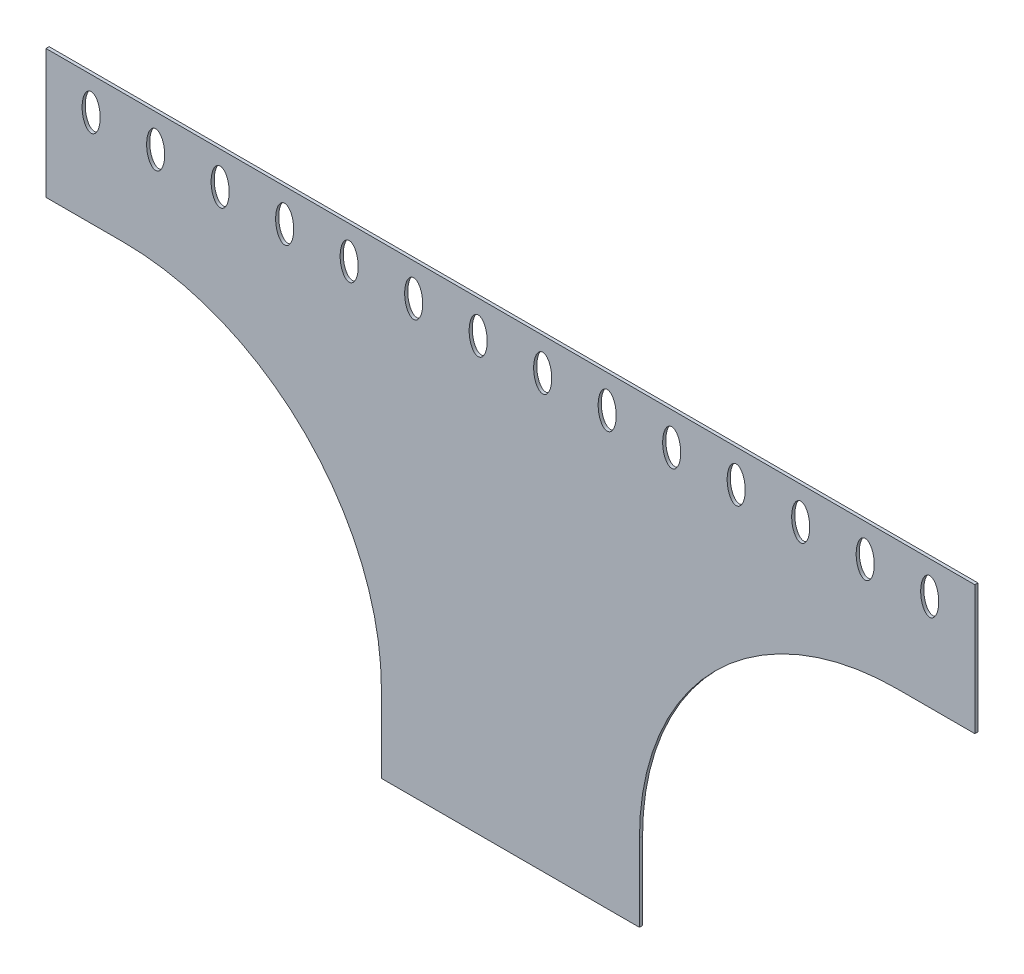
ISO-10303-21;
HEADER;
FILE_DESCRIPTION(('STEP AP214'),'2;1');
FILE_NAME('part.step','',(''),(''),'','','');
FILE_SCHEMA(('AUTOMOTIVE_DESIGN { 1 0 10303 214 1 1 1 1 }'));
ENDSEC;
DATA;
#1=APPLICATION_CONTEXT('core data for automotive mechanical design processes');
#2=APPLICATION_PROTOCOL_DEFINITION('international standard','automotive_design',2000,#1);
#3=PRODUCT_CONTEXT('',#1,'mechanical');
#4=PRODUCT('Part','Part','',(#3));
#5=PRODUCT_RELATED_PRODUCT_CATEGORY('part','',(#4));
#6=PRODUCT_DEFINITION_FORMATION('','',#4);
#7=PRODUCT_DEFINITION_CONTEXT('part definition',#1,'design');
#8=PRODUCT_DEFINITION('design','',#6,#7);
#9=PRODUCT_DEFINITION_SHAPE('','',#8);
#10=(LENGTH_UNIT() NAMED_UNIT(*) SI_UNIT(.MILLI.,.METRE.));
#11=(NAMED_UNIT(*) PLANE_ANGLE_UNIT() SI_UNIT($,.RADIAN.));
#12=(NAMED_UNIT(*) SI_UNIT($,.STERADIAN.) SOLID_ANGLE_UNIT());
#13=UNCERTAINTY_MEASURE_WITH_UNIT(LENGTH_MEASURE(1.E-05),#10,'distance_accuracy_value','');
#14=(GEOMETRIC_REPRESENTATION_CONTEXT(3) GLOBAL_UNCERTAINTY_ASSIGNED_CONTEXT((#13)) GLOBAL_UNIT_ASSIGNED_CONTEXT((#10,
#11,#12)) REPRESENTATION_CONTEXT('',''));
#15=CARTESIAN_POINT('',(0.,0.,0.));
#16=DIRECTION('',(0.,0.,1.));
#17=DIRECTION('',(1.,0.,0.));
#18=AXIS2_PLACEMENT_3D('',#15,#16,#17);
#19=CARTESIAN_POINT('',(0.,30.,1.21412));
#20=DIRECTION('',(1.,0.,0.));
#21=DIRECTION('',(0.,1.,0.));
#22=AXIS2_PLACEMENT_3D('',#19,#20,#21);
#23=PLANE('',#22);
#24=DIRECTION('',(0.,-1.,0.));
#25=VECTOR('',#24,1.);
#26=CARTESIAN_POINT('',(0.,30.,0.));
#27=LINE('',#26,#25);
#28=CARTESIAN_POINT('',(0.,30.,0.));
#29=VERTEX_POINT('',#28);
#30=CARTESIAN_POINT('',(0.,0.,0.));
#31=VERTEX_POINT('',#30);
#32=EDGE_CURVE('E143',#29,#31,#27,.T.);
#33=ORIENTED_EDGE('',*,*,#32,.T.);
#34=DIRECTION('',(0.,0.,-1.));
#35=VECTOR('',#34,1.);
#36=CARTESIAN_POINT('',(0.,0.,1.21412));
#37=LINE('',#36,#35);
#38=CARTESIAN_POINT('',(0.,0.,1.21412));
#39=VERTEX_POINT('',#38);
#40=EDGE_CURVE('E11',#39,#31,#37,.T.);
#41=ORIENTED_EDGE('',*,*,#40,.F.);
#42=DIRECTION('',(0.,-1.,0.));
#43=VECTOR('',#42,1.);
#44=CARTESIAN_POINT('',(0.,30.,1.21412));
#45=LINE('',#44,#43);
#46=CARTESIAN_POINT('',(0.,30.,1.21412));
#47=VERTEX_POINT('',#46);
#48=EDGE_CURVE('E162',#47,#39,#45,.T.);
#49=ORIENTED_EDGE('',*,*,#48,.F.);
#50=DIRECTION('',(0.,0.,-1.));
#51=VECTOR('',#50,1.);
#52=CARTESIAN_POINT('',(0.,30.,1.21412));
#53=LINE('',#52,#51);
#54=EDGE_CURVE('E139',#47,#29,#53,.T.);
#55=ORIENTED_EDGE('',*,*,#54,.T.);
#56=EDGE_LOOP('',(#33,#41,#49,#55));
#57=FACE_BOUND('',#56,.T.);
#58=ADVANCED_FACE('F33',(#57),#23,.F.);
#59=CARTESIAN_POINT('',(0.,0.,1.21412));
#60=DIRECTION('',(0.,1.,0.));
#61=DIRECTION('',(0.,0.,1.));
#62=AXIS2_PLACEMENT_3D('',#59,#60,#61);
#63=PLANE('',#62);
#64=DIRECTION('',(1.,0.,0.));
#65=VECTOR('',#64,1.);
#66=CARTESIAN_POINT('',(0.,0.,0.));
#67=LINE('',#66,#65);
#68=CARTESIAN_POINT('',(100.,0.,0.));
#69=VERTEX_POINT('',#68);
#70=EDGE_CURVE('E146',#31,#69,#67,.T.);
#71=ORIENTED_EDGE('',*,*,#70,.T.);
#72=DIRECTION('',(0.,0.,-1.));
#73=VECTOR('',#72,1.);
#74=CARTESIAN_POINT('',(100.,0.,1.21412));
#75=LINE('',#74,#73);
#76=CARTESIAN_POINT('',(100.,0.,1.21412));
#77=VERTEX_POINT('',#76);
#78=EDGE_CURVE('E42',#77,#69,#75,.T.);
#79=ORIENTED_EDGE('',*,*,#78,.F.);
#80=DIRECTION('',(1.,0.,0.));
#81=VECTOR('',#80,1.);
#82=CARTESIAN_POINT('',(0.,0.,1.21412));
#83=LINE('',#82,#81);
#84=EDGE_CURVE('E100',#39,#77,#83,.T.);
#85=ORIENTED_EDGE('',*,*,#84,.F.);
#86=ORIENTED_EDGE('',*,*,#40,.T.);
#87=EDGE_LOOP('',(#71,#79,#85,#86));
#88=FACE_BOUND('',#87,.T.);
#89=ADVANCED_FACE('F367',(#88),#63,.F.);
#90=CARTESIAN_POINT('',(100.,0.,1.21412));
#91=DIRECTION('',(-1.,0.,0.));
#92=DIRECTION('',(0.,0.,1.));
#93=AXIS2_PLACEMENT_3D('',#90,#91,#92);
#94=PLANE('',#93);
#95=DIRECTION('',(0.,1.,0.));
#96=VECTOR('',#95,1.);
#97=CARTESIAN_POINT('',(100.,0.,0.));
#98=LINE('',#97,#96);
#99=CARTESIAN_POINT('',(100.,30.,0.));
#100=VERTEX_POINT('',#99);
#101=EDGE_CURVE('E149',#69,#100,#98,.T.);
#102=ORIENTED_EDGE('',*,*,#101,.T.);
#103=DIRECTION('',(0.,0.,-1.));
#104=VECTOR('',#103,1.);
#105=CARTESIAN_POINT('',(100.,30.,1.21412));
#106=LINE('',#105,#104);
#107=CARTESIAN_POINT('',(100.,30.,1.21412));
#108=VERTEX_POINT('',#107);
#109=EDGE_CURVE('E175',#108,#100,#106,.T.);
#110=ORIENTED_EDGE('',*,*,#109,.F.);
#111=DIRECTION('',(0.,1.,0.));
#112=VECTOR('',#111,1.);
#113=CARTESIAN_POINT('',(100.,0.,1.21412));
#114=LINE('',#113,#112);
#115=EDGE_CURVE('E332',#77,#108,#114,.T.);
#116=ORIENTED_EDGE('',*,*,#115,.F.);
#117=ORIENTED_EDGE('',*,*,#78,.T.);
#118=EDGE_LOOP('',(#102,#110,#116,#117));
#119=FACE_BOUND('',#118,.T.);
#120=ADVANCED_FACE('F371',(#119),#94,.F.);
#121=CARTESIAN_POINT('',(200.,30.,1.21412));
#122=DIRECTION('',(0.,0.,-1.));
#123=DIRECTION('',(-1.,0.,0.));
#124=AXIS2_PLACEMENT_3D('',#121,#122,#123);
#125=CYLINDRICAL_SURFACE('',#124,100.);
#126=CARTESIAN_POINT('',(200.,30.,0.));
#127=DIRECTION('',(0.,0.,-1.));
#128=DIRECTION('',(-1.,0.,0.));
#129=AXIS2_PLACEMENT_3D('',#126,#127,#128);
#130=CIRCLE('',#129,100.);
#131=CARTESIAN_POINT('',(200.,130.,0.));
#132=VERTEX_POINT('',#131);
#133=EDGE_CURVE('E151',#100,#132,#130,.T.);
#134=ORIENTED_EDGE('',*,*,#133,.T.);
#135=DIRECTION('',(0.,0.,-1.));
#136=VECTOR('',#135,1.);
#137=CARTESIAN_POINT('',(200.,130.,1.21412));
#138=LINE('',#137,#136);
#139=CARTESIAN_POINT('',(200.,130.,1.21412));
#140=VERTEX_POINT('',#139);
#141=EDGE_CURVE('E172',#140,#132,#138,.T.);
#142=ORIENTED_EDGE('',*,*,#141,.F.);
#143=CARTESIAN_POINT('',(200.,30.,1.21412));
#144=DIRECTION('',(0.,0.,-1.));
#145=DIRECTION('',(-1.,0.,0.));
#146=AXIS2_PLACEMENT_3D('',#143,#144,#145);
#147=CIRCLE('',#146,100.);
#148=EDGE_CURVE('E334',#108,#140,#147,.T.);
#149=ORIENTED_EDGE('',*,*,#148,.F.);
#150=ORIENTED_EDGE('',*,*,#109,.T.);
#151=EDGE_LOOP('',(#134,#142,#149,#150));
#152=FACE_BOUND('',#151,.T.);
#153=ADVANCED_FACE('F375',(#152),#125,.F.);
#154=CARTESIAN_POINT('',(200.,130.,1.21412));
#155=DIRECTION('',(0.,1.,0.));
#156=DIRECTION('',(0.,0.,1.));
#157=AXIS2_PLACEMENT_3D('',#154,#155,#156);
#158=PLANE('',#157);
#159=DIRECTION('',(1.,0.,0.));
#160=VECTOR('',#159,1.);
#161=CARTESIAN_POINT('',(200.,130.,0.));
#162=LINE('',#161,#160);
#163=CARTESIAN_POINT('',(230.,130.,0.));
#164=VERTEX_POINT('',#163);
#165=EDGE_CURVE('E153',#132,#164,#162,.T.);
#166=ORIENTED_EDGE('',*,*,#165,.T.);
#167=DIRECTION('',(0.,0.,-1.));
#168=VECTOR('',#167,1.);
#169=CARTESIAN_POINT('',(230.,130.,1.21412));
#170=LINE('',#169,#168);
#171=CARTESIAN_POINT('',(230.,130.,1.21412));
#172=VERTEX_POINT('',#171);
#173=EDGE_CURVE('E169',#172,#164,#170,.T.);
#174=ORIENTED_EDGE('',*,*,#173,.F.);
#175=DIRECTION('',(1.,0.,0.));
#176=VECTOR('',#175,1.);
#177=CARTESIAN_POINT('',(200.,130.,1.21412));
#178=LINE('',#177,#176);
#179=EDGE_CURVE('E336',#140,#172,#178,.T.);
#180=ORIENTED_EDGE('',*,*,#179,.F.);
#181=ORIENTED_EDGE('',*,*,#141,.T.);
#182=EDGE_LOOP('',(#166,#174,#180,#181));
#183=FACE_BOUND('',#182,.T.);
#184=ADVANCED_FACE('F381',(#183),#158,.F.);
#185=CARTESIAN_POINT('',(230.,130.,1.21412));
#186=DIRECTION('',(-1.,0.,0.));
#187=DIRECTION('',(0.,0.,1.));
#188=AXIS2_PLACEMENT_3D('',#185,#186,#187);
#189=PLANE('',#188);
#190=DIRECTION('',(0.,1.,0.));
#191=VECTOR('',#190,1.);
#192=CARTESIAN_POINT('',(230.,130.,0.));
#193=LINE('',#192,#191);
#194=CARTESIAN_POINT('',(230.,180.,0.));
#195=VERTEX_POINT('',#194);
#196=EDGE_CURVE('E155',#164,#195,#193,.T.);
#197=ORIENTED_EDGE('',*,*,#196,.T.);
#198=DIRECTION('',(0.,0.,-1.));
#199=VECTOR('',#198,1.);
#200=CARTESIAN_POINT('',(230.,180.,1.21412));
#201=LINE('',#200,#199);
#202=CARTESIAN_POINT('',(230.,180.,1.21412));
#203=VERTEX_POINT('',#202);
#204=EDGE_CURVE('E166',#203,#195,#201,.T.);
#205=ORIENTED_EDGE('',*,*,#204,.F.);
#206=DIRECTION('',(0.,1.,0.));
#207=VECTOR('',#206,1.);
#208=CARTESIAN_POINT('',(230.,130.,1.21412));
#209=LINE('',#208,#207);
#210=EDGE_CURVE('E338',#172,#203,#209,.T.);
#211=ORIENTED_EDGE('',*,*,#210,.F.);
#212=ORIENTED_EDGE('',*,*,#173,.T.);
#213=EDGE_LOOP('',(#197,#205,#211,#212));
#214=FACE_BOUND('',#213,.T.);
#215=ADVANCED_FACE('F344',(#214),#189,.F.);
#216=CARTESIAN_POINT('',(230.,180.,1.21412));
#217=DIRECTION('',(0.,-1.,0.));
#218=DIRECTION('',(1.,0.,0.));
#219=AXIS2_PLACEMENT_3D('',#216,#217,#218);
#220=PLANE('',#219);
#221=DIRECTION('',(-1.,0.,0.));
#222=VECTOR('',#221,1.);
#223=CARTESIAN_POINT('',(230.,180.,0.));
#224=LINE('',#223,#222);
#225=CARTESIAN_POINT('',(-130.,180.,0.));
#226=VERTEX_POINT('',#225);
#227=EDGE_CURVE('E157',#195,#226,#224,.T.);
#228=ORIENTED_EDGE('',*,*,#227,.T.);
#229=DIRECTION('',(0.,0.,-1.));
#230=VECTOR('',#229,1.);
#231=CARTESIAN_POINT('',(-130.,180.,1.21412));
#232=LINE('',#231,#230);
#233=CARTESIAN_POINT('',(-130.,180.,1.21412));
#234=VERTEX_POINT('',#233);
#235=EDGE_CURVE('E134',#234,#226,#232,.T.);
#236=ORIENTED_EDGE('',*,*,#235,.F.);
#237=DIRECTION('',(-1.,0.,0.));
#238=VECTOR('',#237,1.);
#239=CARTESIAN_POINT('',(230.,180.,1.21412));
#240=LINE('',#239,#238);
#241=EDGE_CURVE('E125',#203,#234,#240,.T.);
#242=ORIENTED_EDGE('',*,*,#241,.F.);
#243=ORIENTED_EDGE('',*,*,#204,.T.);
#244=EDGE_LOOP('',(#228,#236,#242,#243));
#245=FACE_BOUND('',#244,.T.);
#246=ADVANCED_FACE('F348',(#245),#220,.F.);
#247=CARTESIAN_POINT('',(-130.,180.,1.21412));
#248=DIRECTION('',(1.,0.,0.));
#249=DIRECTION('',(0.,1.,0.));
#250=AXIS2_PLACEMENT_3D('',#247,#248,#249);
#251=PLANE('',#250);
#252=DIRECTION('',(0.,-1.,0.));
#253=VECTOR('',#252,1.);
#254=CARTESIAN_POINT('',(-130.,180.,0.));
#255=LINE('',#254,#253);
#256=CARTESIAN_POINT('',(-130.,130.,0.));
#257=VERTEX_POINT('',#256);
#258=EDGE_CURVE('E133',#226,#257,#255,.T.);
#259=ORIENTED_EDGE('',*,*,#258,.T.);
#260=DIRECTION('',(0.,0.,-1.));
#261=VECTOR('',#260,1.);
#262=CARTESIAN_POINT('',(-130.,130.,1.21412));
#263=LINE('',#262,#261);
#264=CARTESIAN_POINT('',(-130.,130.,1.21412));
#265=VERTEX_POINT('',#264);
#266=EDGE_CURVE('E130',#265,#257,#263,.T.);
#267=ORIENTED_EDGE('',*,*,#266,.F.);
#268=DIRECTION('',(0.,-1.,0.));
#269=VECTOR('',#268,1.);
#270=CARTESIAN_POINT('',(-130.,180.,1.21412));
#271=LINE('',#270,#269);
#272=EDGE_CURVE('E119',#234,#265,#271,.T.);
#273=ORIENTED_EDGE('',*,*,#272,.F.);
#274=ORIENTED_EDGE('',*,*,#235,.T.);
#275=EDGE_LOOP('',(#259,#267,#273,#274));
#276=FACE_BOUND('',#275,.T.);
#277=ADVANCED_FACE('F131',(#276),#251,.F.);
#278=CARTESIAN_POINT('',(-130.,130.,1.21412));
#279=DIRECTION('',(0.,1.,0.));
#280=DIRECTION('',(0.,0.,1.));
#281=AXIS2_PLACEMENT_3D('',#278,#279,#280);
#282=PLANE('',#281);
#283=DIRECTION('',(1.,0.,0.));
#284=VECTOR('',#283,1.);
#285=CARTESIAN_POINT('',(-130.,130.,0.));
#286=LINE('',#285,#284);
#287=CARTESIAN_POINT('',(-100.,130.,0.));
#288=VERTEX_POINT('',#287);
#289=EDGE_CURVE('E86',#257,#288,#286,.T.);
#290=ORIENTED_EDGE('',*,*,#289,.T.);
#291=DIRECTION('',(0.,0.,-1.));
#292=VECTOR('',#291,1.);
#293=CARTESIAN_POINT('',(-100.,130.,1.21412));
#294=LINE('',#293,#292);
#295=CARTESIAN_POINT('',(-100.,130.,1.21412));
#296=VERTEX_POINT('',#295);
#297=EDGE_CURVE('E135',#296,#288,#294,.T.);
#298=ORIENTED_EDGE('',*,*,#297,.F.);
#299=DIRECTION('',(1.,0.,0.));
#300=VECTOR('',#299,1.);
#301=CARTESIAN_POINT('',(-130.,130.,1.21412));
#302=LINE('',#301,#300);
#303=EDGE_CURVE('E123',#265,#296,#302,.T.);
#304=ORIENTED_EDGE('',*,*,#303,.F.);
#305=ORIENTED_EDGE('',*,*,#266,.T.);
#306=EDGE_LOOP('',(#290,#298,#304,#305));
#307=FACE_BOUND('',#306,.T.);
#308=ADVANCED_FACE('F137',(#307),#282,.F.);
#309=CARTESIAN_POINT('',(-100.,30.,1.21412));
#310=DIRECTION('',(0.,0.,-1.));
#311=DIRECTION('',(-1.,0.,0.));
#312=AXIS2_PLACEMENT_3D('',#309,#310,#311);
#313=CYLINDRICAL_SURFACE('',#312,100.);
#314=CARTESIAN_POINT('',(-100.,30.,0.));
#315=DIRECTION('',(0.,0.,-1.));
#316=DIRECTION('',(-1.,0.,0.));
#317=AXIS2_PLACEMENT_3D('',#314,#315,#316);
#318=CIRCLE('',#317,100.);
#319=EDGE_CURVE('E92',#288,#29,#318,.T.);
#320=ORIENTED_EDGE('',*,*,#319,.T.);
#321=ORIENTED_EDGE('',*,*,#54,.F.);
#322=CARTESIAN_POINT('',(-100.,30.,1.21412));
#323=DIRECTION('',(0.,0.,-1.));
#324=DIRECTION('',(-1.,0.,0.));
#325=AXIS2_PLACEMENT_3D('',#322,#323,#324);
#326=CIRCLE('',#325,100.);
#327=EDGE_CURVE('E51',#296,#47,#326,.T.);
#328=ORIENTED_EDGE('',*,*,#327,.F.);
#329=ORIENTED_EDGE('',*,*,#297,.T.);
#330=EDGE_LOOP('',(#320,#321,#328,#329));
#331=FACE_BOUND('',#330,.T.);
#332=ADVANCED_FACE('F356',(#331),#313,.F.);
#333=CARTESIAN_POINT('',(200.,30.,1.21412));
#334=DIRECTION('',(0.,0.,-1.));
#335=DIRECTION('',(-1.,0.,0.));
#336=AXIS2_PLACEMENT_3D('',#333,#334,#335);
#337=PLANE('',#336);
#338=CARTESIAN_POINT('',(-112.5,167.3,1.21412));
#339=DIRECTION('',(0.,0.,1.));
#340=DIRECTION('',(0.,1.,0.));
#341=AXIS2_PLACEMENT_3D('',#338,#339,#340);
#342=ELLIPSE('',#341,7.00000000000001,3.5);
#343=CARTESIAN_POINT('',(-112.5,174.3,1.21412));
#344=VERTEX_POINT('',#343);
#345=EDGE_CURVE('E238',#344,#344,#342,.T.);
#346=ORIENTED_EDGE('',*,*,#345,.F.);
#347=EDGE_LOOP('',(#346));
#348=FACE_BOUND('',#347,.T.);
#349=CARTESIAN_POINT('',(-87.5,167.3,1.21412));
#350=DIRECTION('',(0.,0.,1.));
#351=DIRECTION('',(0.,1.,0.));
#352=AXIS2_PLACEMENT_3D('',#349,#350,#351);
#353=ELLIPSE('',#352,7.00000000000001,3.5);
#354=CARTESIAN_POINT('',(-87.5,174.3,1.21412));
#355=VERTEX_POINT('',#354);
#356=EDGE_CURVE('E228',#355,#355,#353,.T.);
#357=ORIENTED_EDGE('',*,*,#356,.F.);
#358=EDGE_LOOP('',(#357));
#359=FACE_BOUND('',#358,.T.);
#360=CARTESIAN_POINT('',(-62.5,167.3,1.21412));
#361=DIRECTION('',(0.,0.,1.));
#362=DIRECTION('',(0.,1.,0.));
#363=AXIS2_PLACEMENT_3D('',#360,#361,#362);
#364=ELLIPSE('',#363,7.00000000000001,3.5);
#365=CARTESIAN_POINT('',(-62.5,174.3,1.21412));
#366=VERTEX_POINT('',#365);
#367=EDGE_CURVE('E225',#366,#366,#364,.T.);
#368=ORIENTED_EDGE('',*,*,#367,.F.);
#369=EDGE_LOOP('',(#368));
#370=FACE_BOUND('',#369,.T.);
#371=CARTESIAN_POINT('',(-37.5,167.3,1.21412));
#372=DIRECTION('',(0.,0.,1.));
#373=DIRECTION('',(0.,1.,0.));
#374=AXIS2_PLACEMENT_3D('',#371,#372,#373);
#375=ELLIPSE('',#374,7.00000000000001,3.5);
#376=CARTESIAN_POINT('',(-37.5,174.3,1.21412));
#377=VERTEX_POINT('',#376);
#378=EDGE_CURVE('E222',#377,#377,#375,.T.);
#379=ORIENTED_EDGE('',*,*,#378,.F.);
#380=EDGE_LOOP('',(#379));
#381=FACE_BOUND('',#380,.T.);
#382=CARTESIAN_POINT('',(-12.5,167.3,1.21412));
#383=DIRECTION('',(0.,0.,1.));
#384=DIRECTION('',(0.,1.,0.));
#385=AXIS2_PLACEMENT_3D('',#382,#383,#384);
#386=ELLIPSE('',#385,7.00000000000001,3.5);
#387=CARTESIAN_POINT('',(-12.5,174.3,1.21412));
#388=VERTEX_POINT('',#387);
#389=EDGE_CURVE('E218',#388,#388,#386,.T.);
#390=ORIENTED_EDGE('',*,*,#389,.F.);
#391=EDGE_LOOP('',(#390));
#392=FACE_BOUND('',#391,.T.);
#393=CARTESIAN_POINT('',(12.5,167.3,1.21412));
#394=DIRECTION('',(0.,0.,1.));
#395=DIRECTION('',(0.,1.,0.));
#396=AXIS2_PLACEMENT_3D('',#393,#394,#395);
#397=ELLIPSE('',#396,7.00000000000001,3.5);
#398=CARTESIAN_POINT('',(12.5,174.3,1.21412));
#399=VERTEX_POINT('',#398);
#400=EDGE_CURVE('E214',#399,#399,#397,.T.);
#401=ORIENTED_EDGE('',*,*,#400,.F.);
#402=EDGE_LOOP('',(#401));
#403=FACE_BOUND('',#402,.T.);
#404=CARTESIAN_POINT('',(37.5,167.3,1.21412));
#405=DIRECTION('',(0.,0.,1.));
#406=DIRECTION('',(0.,1.,0.));
#407=AXIS2_PLACEMENT_3D('',#404,#405,#406);
#408=ELLIPSE('',#407,7.00000000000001,3.5);
#409=CARTESIAN_POINT('',(37.5,174.3,1.21412));
#410=VERTEX_POINT('',#409);
#411=EDGE_CURVE('E210',#410,#410,#408,.T.);
#412=ORIENTED_EDGE('',*,*,#411,.F.);
#413=EDGE_LOOP('',(#412));
#414=FACE_BOUND('',#413,.T.);
#415=CARTESIAN_POINT('',(212.5,167.3,1.21412));
#416=DIRECTION('',(0.,0.,1.));
#417=DIRECTION('',(0.,1.,0.));
#418=AXIS2_PLACEMENT_3D('',#415,#416,#417);
#419=ELLIPSE('',#418,7.00000000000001,3.5);
#420=CARTESIAN_POINT('',(212.5,174.3,1.21412));
#421=VERTEX_POINT('',#420);
#422=EDGE_CURVE('E206',#421,#421,#419,.T.);
#423=ORIENTED_EDGE('',*,*,#422,.F.);
#424=EDGE_LOOP('',(#423));
#425=FACE_BOUND('',#424,.T.);
#426=CARTESIAN_POINT('',(187.5,167.3,1.21412));
#427=DIRECTION('',(0.,0.,1.));
#428=DIRECTION('',(0.,1.,0.));
#429=AXIS2_PLACEMENT_3D('',#426,#427,#428);
#430=ELLIPSE('',#429,7.00000000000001,3.5);
#431=CARTESIAN_POINT('',(187.5,174.3,1.21412));
#432=VERTEX_POINT('',#431);
#433=EDGE_CURVE('E202',#432,#432,#430,.T.);
#434=ORIENTED_EDGE('',*,*,#433,.F.);
#435=EDGE_LOOP('',(#434));
#436=FACE_BOUND('',#435,.T.);
#437=CARTESIAN_POINT('',(162.5,167.3,1.21412));
#438=DIRECTION('',(0.,0.,1.));
#439=DIRECTION('',(0.,1.,0.));
#440=AXIS2_PLACEMENT_3D('',#437,#438,#439);
#441=ELLIPSE('',#440,7.00000000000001,3.5);
#442=CARTESIAN_POINT('',(162.5,174.3,1.21412));
#443=VERTEX_POINT('',#442);
#444=EDGE_CURVE('E198',#443,#443,#441,.T.);
#445=ORIENTED_EDGE('',*,*,#444,.F.);
#446=EDGE_LOOP('',(#445));
#447=FACE_BOUND('',#446,.T.);
#448=CARTESIAN_POINT('',(137.5,167.3,1.21412));
#449=DIRECTION('',(0.,0.,1.));
#450=DIRECTION('',(0.,1.,0.));
#451=AXIS2_PLACEMENT_3D('',#448,#449,#450);
#452=ELLIPSE('',#451,7.00000000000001,3.5);
#453=CARTESIAN_POINT('',(137.5,174.3,1.21412));
#454=VERTEX_POINT('',#453);
#455=EDGE_CURVE('E194',#454,#454,#452,.T.);
#456=ORIENTED_EDGE('',*,*,#455,.F.);
#457=EDGE_LOOP('',(#456));
#458=FACE_BOUND('',#457,.T.);
#459=CARTESIAN_POINT('',(112.5,167.3,1.21412));
#460=DIRECTION('',(0.,0.,1.));
#461=DIRECTION('',(0.,1.,0.));
#462=AXIS2_PLACEMENT_3D('',#459,#460,#461);
#463=ELLIPSE('',#462,7.00000000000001,3.5);
#464=CARTESIAN_POINT('',(112.5,174.3,1.21412));
#465=VERTEX_POINT('',#464);
#466=EDGE_CURVE('E190',#465,#465,#463,.T.);
#467=ORIENTED_EDGE('',*,*,#466,.F.);
#468=EDGE_LOOP('',(#467));
#469=FACE_BOUND('',#468,.T.);
#470=CARTESIAN_POINT('',(87.5,167.3,1.21412));
#471=DIRECTION('',(0.,0.,1.));
#472=DIRECTION('',(0.,1.,0.));
#473=AXIS2_PLACEMENT_3D('',#470,#471,#472);
#474=ELLIPSE('',#473,7.00000000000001,3.5);
#475=CARTESIAN_POINT('',(87.5,174.3,1.21412));
#476=VERTEX_POINT('',#475);
#477=EDGE_CURVE('E186',#476,#476,#474,.T.);
#478=ORIENTED_EDGE('',*,*,#477,.F.);
#479=EDGE_LOOP('',(#478));
#480=FACE_BOUND('',#479,.T.);
#481=CARTESIAN_POINT('',(62.5,167.3,1.21412));
#482=DIRECTION('',(0.,0.,1.));
#483=DIRECTION('',(0.,1.,0.));
#484=AXIS2_PLACEMENT_3D('',#481,#482,#483);
#485=ELLIPSE('',#484,7.00000000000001,3.5);
#486=CARTESIAN_POINT('',(62.5,174.3,1.21412));
#487=VERTEX_POINT('',#486);
#488=EDGE_CURVE('E182',#487,#487,#485,.T.);
#489=ORIENTED_EDGE('',*,*,#488,.F.);
#490=EDGE_LOOP('',(#489));
#491=FACE_BOUND('',#490,.T.);
#492=ORIENTED_EDGE('',*,*,#48,.T.);
#493=ORIENTED_EDGE('',*,*,#84,.T.);
#494=ORIENTED_EDGE('',*,*,#115,.T.);
#495=ORIENTED_EDGE('',*,*,#148,.T.);
#496=ORIENTED_EDGE('',*,*,#179,.T.);
#497=ORIENTED_EDGE('',*,*,#210,.T.);
#498=ORIENTED_EDGE('',*,*,#241,.T.);
#499=ORIENTED_EDGE('',*,*,#272,.T.);
#500=ORIENTED_EDGE('',*,*,#303,.T.);
#501=ORIENTED_EDGE('',*,*,#327,.T.);
#502=EDGE_LOOP('',(#492,#493,#494,#495,#496,#497,#498,#499,#500,#501));
#503=FACE_BOUND('',#502,.T.);
#504=ADVANCED_FACE('F121',(#348,#359,#370,#381,#392,#403,#414,#425,#436,#447,#458,#469,#480,
#491,#503),#337,.F.);
#505=CARTESIAN_POINT('',(200.,30.,0.));
#506=DIRECTION('',(0.,0.,-1.));
#507=DIRECTION('',(-1.,0.,0.));
#508=AXIS2_PLACEMENT_3D('',#505,#506,#507);
#509=PLANE('',#508);
#510=CARTESIAN_POINT('',(-112.5,167.3,0.));
#511=DIRECTION('',(0.,0.,1.));
#512=DIRECTION('',(0.,1.,0.));
#513=AXIS2_PLACEMENT_3D('',#510,#511,#512);
#514=ELLIPSE('',#513,7.00000000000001,3.5);
#515=CARTESIAN_POINT('',(-112.5,174.3,0.));
#516=VERTEX_POINT('',#515);
#517=EDGE_CURVE('E36',#516,#516,#514,.F.);
#518=ORIENTED_EDGE('',*,*,#517,.F.);
#519=EDGE_LOOP('',(#518));
#520=FACE_BOUND('',#519,.T.);
#521=CARTESIAN_POINT('',(-87.5,167.3,0.));
#522=DIRECTION('',(0.,0.,1.));
#523=DIRECTION('',(0.,1.,0.));
#524=AXIS2_PLACEMENT_3D('',#521,#522,#523);
#525=ELLIPSE('',#524,7.00000000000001,3.5);
#526=CARTESIAN_POINT('',(-87.5,174.3,0.));
#527=VERTEX_POINT('',#526);
#528=EDGE_CURVE('E226',#527,#527,#525,.F.);
#529=ORIENTED_EDGE('',*,*,#528,.F.);
#530=EDGE_LOOP('',(#529));
#531=FACE_BOUND('',#530,.T.);
#532=CARTESIAN_POINT('',(-62.5,167.3,0.));
#533=DIRECTION('',(0.,0.,1.));
#534=DIRECTION('',(0.,1.,0.));
#535=AXIS2_PLACEMENT_3D('',#532,#533,#534);
#536=ELLIPSE('',#535,7.00000000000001,3.5);
#537=CARTESIAN_POINT('',(-62.5,174.3,0.));
#538=VERTEX_POINT('',#537);
#539=EDGE_CURVE('E223',#538,#538,#536,.F.);
#540=ORIENTED_EDGE('',*,*,#539,.F.);
#541=EDGE_LOOP('',(#540));
#542=FACE_BOUND('',#541,.T.);
#543=CARTESIAN_POINT('',(-37.5,167.3,0.));
#544=DIRECTION('',(0.,0.,1.));
#545=DIRECTION('',(0.,1.,0.));
#546=AXIS2_PLACEMENT_3D('',#543,#544,#545);
#547=ELLIPSE('',#546,7.00000000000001,3.5);
#548=CARTESIAN_POINT('',(-37.5,174.3,0.));
#549=VERTEX_POINT('',#548);
#550=EDGE_CURVE('E219',#549,#549,#547,.F.);
#551=ORIENTED_EDGE('',*,*,#550,.F.);
#552=EDGE_LOOP('',(#551));
#553=FACE_BOUND('',#552,.T.);
#554=CARTESIAN_POINT('',(-12.5,167.3,0.));
#555=DIRECTION('',(0.,0.,1.));
#556=DIRECTION('',(0.,1.,0.));
#557=AXIS2_PLACEMENT_3D('',#554,#555,#556);
#558=ELLIPSE('',#557,7.00000000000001,3.5);
#559=CARTESIAN_POINT('',(-12.5,174.3,0.));
#560=VERTEX_POINT('',#559);
#561=EDGE_CURVE('E215',#560,#560,#558,.F.);
#562=ORIENTED_EDGE('',*,*,#561,.F.);
#563=EDGE_LOOP('',(#562));
#564=FACE_BOUND('',#563,.T.);
#565=CARTESIAN_POINT('',(12.5,167.3,0.));
#566=DIRECTION('',(0.,0.,1.));
#567=DIRECTION('',(0.,1.,0.));
#568=AXIS2_PLACEMENT_3D('',#565,#566,#567);
#569=ELLIPSE('',#568,7.00000000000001,3.5);
#570=CARTESIAN_POINT('',(12.5,174.3,0.));
#571=VERTEX_POINT('',#570);
#572=EDGE_CURVE('E211',#571,#571,#569,.F.);
#573=ORIENTED_EDGE('',*,*,#572,.F.);
#574=EDGE_LOOP('',(#573));
#575=FACE_BOUND('',#574,.T.);
#576=CARTESIAN_POINT('',(37.5,167.3,0.));
#577=DIRECTION('',(0.,0.,1.));
#578=DIRECTION('',(0.,1.,0.));
#579=AXIS2_PLACEMENT_3D('',#576,#577,#578);
#580=ELLIPSE('',#579,7.00000000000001,3.5);
#581=CARTESIAN_POINT('',(37.5,174.3,0.));
#582=VERTEX_POINT('',#581);
#583=EDGE_CURVE('E207',#582,#582,#580,.F.);
#584=ORIENTED_EDGE('',*,*,#583,.F.);
#585=EDGE_LOOP('',(#584));
#586=FACE_BOUND('',#585,.T.);
#587=CARTESIAN_POINT('',(212.5,167.3,0.));
#588=DIRECTION('',(0.,0.,1.));
#589=DIRECTION('',(0.,1.,0.));
#590=AXIS2_PLACEMENT_3D('',#587,#588,#589);
#591=ELLIPSE('',#590,7.00000000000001,3.5);
#592=CARTESIAN_POINT('',(212.5,174.3,0.));
#593=VERTEX_POINT('',#592);
#594=EDGE_CURVE('E203',#593,#593,#591,.F.);
#595=ORIENTED_EDGE('',*,*,#594,.F.);
#596=EDGE_LOOP('',(#595));
#597=FACE_BOUND('',#596,.T.);
#598=CARTESIAN_POINT('',(187.5,167.3,0.));
#599=DIRECTION('',(0.,0.,1.));
#600=DIRECTION('',(0.,1.,0.));
#601=AXIS2_PLACEMENT_3D('',#598,#599,#600);
#602=ELLIPSE('',#601,7.00000000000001,3.5);
#603=CARTESIAN_POINT('',(187.5,174.3,0.));
#604=VERTEX_POINT('',#603);
#605=EDGE_CURVE('E199',#604,#604,#602,.F.);
#606=ORIENTED_EDGE('',*,*,#605,.F.);
#607=EDGE_LOOP('',(#606));
#608=FACE_BOUND('',#607,.T.);
#609=CARTESIAN_POINT('',(162.5,167.3,0.));
#610=DIRECTION('',(0.,0.,1.));
#611=DIRECTION('',(0.,1.,0.));
#612=AXIS2_PLACEMENT_3D('',#609,#610,#611);
#613=ELLIPSE('',#612,7.00000000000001,3.5);
#614=CARTESIAN_POINT('',(162.5,174.3,0.));
#615=VERTEX_POINT('',#614);
#616=EDGE_CURVE('E195',#615,#615,#613,.F.);
#617=ORIENTED_EDGE('',*,*,#616,.F.);
#618=EDGE_LOOP('',(#617));
#619=FACE_BOUND('',#618,.T.);
#620=CARTESIAN_POINT('',(137.5,167.3,0.));
#621=DIRECTION('',(0.,0.,1.));
#622=DIRECTION('',(0.,1.,0.));
#623=AXIS2_PLACEMENT_3D('',#620,#621,#622);
#624=ELLIPSE('',#623,7.00000000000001,3.5);
#625=CARTESIAN_POINT('',(137.5,174.3,0.));
#626=VERTEX_POINT('',#625);
#627=EDGE_CURVE('E191',#626,#626,#624,.F.);
#628=ORIENTED_EDGE('',*,*,#627,.F.);
#629=EDGE_LOOP('',(#628));
#630=FACE_BOUND('',#629,.T.);
#631=CARTESIAN_POINT('',(112.5,167.3,0.));
#632=DIRECTION('',(0.,0.,1.));
#633=DIRECTION('',(0.,1.,0.));
#634=AXIS2_PLACEMENT_3D('',#631,#632,#633);
#635=ELLIPSE('',#634,7.00000000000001,3.5);
#636=CARTESIAN_POINT('',(112.5,174.3,0.));
#637=VERTEX_POINT('',#636);
#638=EDGE_CURVE('E187',#637,#637,#635,.F.);
#639=ORIENTED_EDGE('',*,*,#638,.F.);
#640=EDGE_LOOP('',(#639));
#641=FACE_BOUND('',#640,.T.);
#642=CARTESIAN_POINT('',(87.5,167.3,0.));
#643=DIRECTION('',(0.,0.,1.));
#644=DIRECTION('',(0.,1.,0.));
#645=AXIS2_PLACEMENT_3D('',#642,#643,#644);
#646=ELLIPSE('',#645,7.00000000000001,3.5);
#647=CARTESIAN_POINT('',(87.5,174.3,0.));
#648=VERTEX_POINT('',#647);
#649=EDGE_CURVE('E183',#648,#648,#646,.F.);
#650=ORIENTED_EDGE('',*,*,#649,.F.);
#651=EDGE_LOOP('',(#650));
#652=FACE_BOUND('',#651,.T.);
#653=CARTESIAN_POINT('',(62.5,167.3,0.));
#654=DIRECTION('',(0.,0.,1.));
#655=DIRECTION('',(0.,1.,0.));
#656=AXIS2_PLACEMENT_3D('',#653,#654,#655);
#657=ELLIPSE('',#656,7.00000000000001,3.5);
#658=CARTESIAN_POINT('',(62.5,174.3,0.));
#659=VERTEX_POINT('',#658);
#660=EDGE_CURVE('E147',#659,#659,#657,.F.);
#661=ORIENTED_EDGE('',*,*,#660,.F.);
#662=EDGE_LOOP('',(#661));
#663=FACE_BOUND('',#662,.T.);
#664=ORIENTED_EDGE('',*,*,#32,.F.);
#665=ORIENTED_EDGE('',*,*,#319,.F.);
#666=ORIENTED_EDGE('',*,*,#289,.F.);
#667=ORIENTED_EDGE('',*,*,#258,.F.);
#668=ORIENTED_EDGE('',*,*,#227,.F.);
#669=ORIENTED_EDGE('',*,*,#196,.F.);
#670=ORIENTED_EDGE('',*,*,#165,.F.);
#671=ORIENTED_EDGE('',*,*,#133,.F.);
#672=ORIENTED_EDGE('',*,*,#101,.F.);
#673=ORIENTED_EDGE('',*,*,#70,.F.);
#674=EDGE_LOOP('',(#664,#665,#666,#667,#668,#669,#670,#671,#672,#673));
#675=FACE_BOUND('',#674,.T.);
#676=ADVANCED_FACE('F351',(#520,#531,#542,#553,#564,#575,#586,#597,#608,#619,#630,#641,#652,
#663,#675),#509,.T.);
#677=CARTESIAN_POINT('',(62.5,167.3,-8.78588));
#678=DIRECTION('',(0.,0.,1.));
#679=DIRECTION('',(0.,1.,0.));
#680=AXIS2_PLACEMENT_3D('',#677,#678,#679);
#681=ELLIPSE('',#680,7.00000000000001,3.5);
#682=DIRECTION('',(0.,0.,1.));
#683=VECTOR('',#682,1.);
#684=SURFACE_OF_LINEAR_EXTRUSION('',#681,#683);
#685=ORIENTED_EDGE('',*,*,#660,.T.);
#686=EDGE_LOOP('',(#685));
#687=FACE_BOUND('',#686,.T.);
#688=ORIENTED_EDGE('',*,*,#488,.T.);
#689=EDGE_LOOP('',(#688));
#690=FACE_BOUND('',#689,.T.);
#691=ADVANCED_FACE('F319',(#687,#690),#684,.F.);
#692=CARTESIAN_POINT('',(87.5,167.3,-8.78588));
#693=DIRECTION('',(0.,0.,1.));
#694=DIRECTION('',(0.,1.,0.));
#695=AXIS2_PLACEMENT_3D('',#692,#693,#694);
#696=ELLIPSE('',#695,7.00000000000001,3.5);
#697=DIRECTION('',(0.,0.,1.));
#698=VECTOR('',#697,1.);
#699=SURFACE_OF_LINEAR_EXTRUSION('',#696,#698);
#700=ORIENTED_EDGE('',*,*,#649,.T.);
#701=EDGE_LOOP('',(#700));
#702=FACE_BOUND('',#701,.T.);
#703=ORIENTED_EDGE('',*,*,#477,.T.);
#704=EDGE_LOOP('',(#703));
#705=FACE_BOUND('',#704,.T.);
#706=ADVANCED_FACE('F315',(#702,#705),#699,.F.);
#707=CARTESIAN_POINT('',(112.5,167.3,-8.78588));
#708=DIRECTION('',(0.,0.,1.));
#709=DIRECTION('',(0.,1.,0.));
#710=AXIS2_PLACEMENT_3D('',#707,#708,#709);
#711=ELLIPSE('',#710,7.00000000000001,3.5);
#712=DIRECTION('',(0.,0.,1.));
#713=VECTOR('',#712,1.);
#714=SURFACE_OF_LINEAR_EXTRUSION('',#711,#713);
#715=ORIENTED_EDGE('',*,*,#638,.T.);
#716=EDGE_LOOP('',(#715));
#717=FACE_BOUND('',#716,.T.);
#718=ORIENTED_EDGE('',*,*,#466,.T.);
#719=EDGE_LOOP('',(#718));
#720=FACE_BOUND('',#719,.T.);
#721=ADVANCED_FACE('F312',(#717,#720),#714,.F.);
#722=CARTESIAN_POINT('',(137.5,167.3,-8.78588));
#723=DIRECTION('',(0.,0.,1.));
#724=DIRECTION('',(0.,1.,0.));
#725=AXIS2_PLACEMENT_3D('',#722,#723,#724);
#726=ELLIPSE('',#725,7.00000000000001,3.5);
#727=DIRECTION('',(0.,0.,1.));
#728=VECTOR('',#727,1.);
#729=SURFACE_OF_LINEAR_EXTRUSION('',#726,#728);
#730=ORIENTED_EDGE('',*,*,#627,.T.);
#731=EDGE_LOOP('',(#730));
#732=FACE_BOUND('',#731,.T.);
#733=ORIENTED_EDGE('',*,*,#455,.T.);
#734=EDGE_LOOP('',(#733));
#735=FACE_BOUND('',#734,.T.);
#736=ADVANCED_FACE('F298',(#732,#735),#729,.F.);
#737=CARTESIAN_POINT('',(162.5,167.3,-8.78588));
#738=DIRECTION('',(0.,0.,1.));
#739=DIRECTION('',(0.,1.,0.));
#740=AXIS2_PLACEMENT_3D('',#737,#738,#739);
#741=ELLIPSE('',#740,7.00000000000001,3.5);
#742=DIRECTION('',(0.,0.,1.));
#743=VECTOR('',#742,1.);
#744=SURFACE_OF_LINEAR_EXTRUSION('',#741,#743);
#745=ORIENTED_EDGE('',*,*,#616,.T.);
#746=EDGE_LOOP('',(#745));
#747=FACE_BOUND('',#746,.T.);
#748=ORIENTED_EDGE('',*,*,#444,.T.);
#749=EDGE_LOOP('',(#748));
#750=FACE_BOUND('',#749,.T.);
#751=ADVANCED_FACE('F294',(#747,#750),#744,.F.);
#752=CARTESIAN_POINT('',(187.5,167.3,-8.78588));
#753=DIRECTION('',(0.,0.,1.));
#754=DIRECTION('',(0.,1.,0.));
#755=AXIS2_PLACEMENT_3D('',#752,#753,#754);
#756=ELLIPSE('',#755,7.00000000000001,3.5);
#757=DIRECTION('',(0.,0.,1.));
#758=VECTOR('',#757,1.);
#759=SURFACE_OF_LINEAR_EXTRUSION('',#756,#758);
#760=ORIENTED_EDGE('',*,*,#605,.T.);
#761=EDGE_LOOP('',(#760));
#762=FACE_BOUND('',#761,.T.);
#763=ORIENTED_EDGE('',*,*,#433,.T.);
#764=EDGE_LOOP('',(#763));
#765=FACE_BOUND('',#764,.T.);
#766=ADVANCED_FACE('F291',(#762,#765),#759,.F.);
#767=CARTESIAN_POINT('',(212.5,167.3,-8.78588));
#768=DIRECTION('',(0.,0.,1.));
#769=DIRECTION('',(0.,1.,0.));
#770=AXIS2_PLACEMENT_3D('',#767,#768,#769);
#771=ELLIPSE('',#770,7.00000000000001,3.5);
#772=DIRECTION('',(0.,0.,1.));
#773=VECTOR('',#772,1.);
#774=SURFACE_OF_LINEAR_EXTRUSION('',#771,#773);
#775=ORIENTED_EDGE('',*,*,#594,.T.);
#776=EDGE_LOOP('',(#775));
#777=FACE_BOUND('',#776,.T.);
#778=ORIENTED_EDGE('',*,*,#422,.T.);
#779=EDGE_LOOP('',(#778));
#780=FACE_BOUND('',#779,.T.);
#781=ADVANCED_FACE('F277',(#777,#780),#774,.F.);
#782=CARTESIAN_POINT('',(37.5,167.3,-8.78588));
#783=DIRECTION('',(0.,0.,1.));
#784=DIRECTION('',(0.,1.,0.));
#785=AXIS2_PLACEMENT_3D('',#782,#783,#784);
#786=ELLIPSE('',#785,7.00000000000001,3.5);
#787=DIRECTION('',(0.,0.,1.));
#788=VECTOR('',#787,1.);
#789=SURFACE_OF_LINEAR_EXTRUSION('',#786,#788);
#790=ORIENTED_EDGE('',*,*,#583,.T.);
#791=EDGE_LOOP('',(#790));
#792=FACE_BOUND('',#791,.T.);
#793=ORIENTED_EDGE('',*,*,#411,.T.);
#794=EDGE_LOOP('',(#793));
#795=FACE_BOUND('',#794,.T.);
#796=ADVANCED_FACE('F273',(#792,#795),#789,.F.);
#797=CARTESIAN_POINT('',(12.5,167.3,-8.78588));
#798=DIRECTION('',(0.,0.,1.));
#799=DIRECTION('',(0.,1.,0.));
#800=AXIS2_PLACEMENT_3D('',#797,#798,#799);
#801=ELLIPSE('',#800,7.00000000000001,3.5);
#802=DIRECTION('',(0.,0.,1.));
#803=VECTOR('',#802,1.);
#804=SURFACE_OF_LINEAR_EXTRUSION('',#801,#803);
#805=ORIENTED_EDGE('',*,*,#572,.T.);
#806=EDGE_LOOP('',(#805));
#807=FACE_BOUND('',#806,.T.);
#808=ORIENTED_EDGE('',*,*,#400,.T.);
#809=EDGE_LOOP('',(#808));
#810=FACE_BOUND('',#809,.T.);
#811=ADVANCED_FACE('F270',(#807,#810),#804,.F.);
#812=CARTESIAN_POINT('',(-12.5,167.3,-8.78588));
#813=DIRECTION('',(0.,0.,1.));
#814=DIRECTION('',(0.,1.,0.));
#815=AXIS2_PLACEMENT_3D('',#812,#813,#814);
#816=ELLIPSE('',#815,7.00000000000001,3.5);
#817=DIRECTION('',(0.,0.,1.));
#818=VECTOR('',#817,1.);
#819=SURFACE_OF_LINEAR_EXTRUSION('',#816,#818);
#820=ORIENTED_EDGE('',*,*,#561,.T.);
#821=EDGE_LOOP('',(#820));
#822=FACE_BOUND('',#821,.T.);
#823=ORIENTED_EDGE('',*,*,#389,.T.);
#824=EDGE_LOOP('',(#823));
#825=FACE_BOUND('',#824,.T.);
#826=ADVANCED_FACE('F256',(#822,#825),#819,.F.);
#827=CARTESIAN_POINT('',(-37.5,167.3,-8.78588));
#828=DIRECTION('',(0.,0.,1.));
#829=DIRECTION('',(0.,1.,0.));
#830=AXIS2_PLACEMENT_3D('',#827,#828,#829);
#831=ELLIPSE('',#830,7.00000000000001,3.5);
#832=DIRECTION('',(0.,0.,1.));
#833=VECTOR('',#832,1.);
#834=SURFACE_OF_LINEAR_EXTRUSION('',#831,#833);
#835=ORIENTED_EDGE('',*,*,#550,.T.);
#836=EDGE_LOOP('',(#835));
#837=FACE_BOUND('',#836,.T.);
#838=ORIENTED_EDGE('',*,*,#378,.T.);
#839=EDGE_LOOP('',(#838));
#840=FACE_BOUND('',#839,.T.);
#841=ADVANCED_FACE('F251',(#837,#840),#834,.F.);
#842=CARTESIAN_POINT('',(-62.5,167.3,-8.78588));
#843=DIRECTION('',(0.,0.,1.));
#844=DIRECTION('',(0.,1.,0.));
#845=AXIS2_PLACEMENT_3D('',#842,#843,#844);
#846=ELLIPSE('',#845,7.00000000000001,3.5);
#847=DIRECTION('',(0.,0.,1.));
#848=VECTOR('',#847,1.);
#849=SURFACE_OF_LINEAR_EXTRUSION('',#846,#848);
#850=ORIENTED_EDGE('',*,*,#539,.T.);
#851=EDGE_LOOP('',(#850));
#852=FACE_BOUND('',#851,.T.);
#853=ORIENTED_EDGE('',*,*,#367,.T.);
#854=EDGE_LOOP('',(#853));
#855=FACE_BOUND('',#854,.T.);
#856=ADVANCED_FACE('F246',(#852,#855),#849,.F.);
#857=CARTESIAN_POINT('',(-87.5,167.3,-8.78588));
#858=DIRECTION('',(0.,0.,1.));
#859=DIRECTION('',(0.,1.,0.));
#860=AXIS2_PLACEMENT_3D('',#857,#858,#859);
#861=ELLIPSE('',#860,7.00000000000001,3.5);
#862=DIRECTION('',(0.,0.,1.));
#863=VECTOR('',#862,1.);
#864=SURFACE_OF_LINEAR_EXTRUSION('',#861,#863);
#865=ORIENTED_EDGE('',*,*,#528,.T.);
#866=EDGE_LOOP('',(#865));
#867=FACE_BOUND('',#866,.T.);
#868=ORIENTED_EDGE('',*,*,#356,.T.);
#869=EDGE_LOOP('',(#868));
#870=FACE_BOUND('',#869,.T.);
#871=ADVANCED_FACE('F250',(#867,#870),#864,.F.);
#872=CARTESIAN_POINT('',(-112.5,167.3,-8.78588));
#873=DIRECTION('',(0.,0.,1.));
#874=DIRECTION('',(0.,1.,0.));
#875=AXIS2_PLACEMENT_3D('',#872,#873,#874);
#876=ELLIPSE('',#875,7.00000000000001,3.5);
#877=DIRECTION('',(0.,0.,1.));
#878=VECTOR('',#877,1.);
#879=SURFACE_OF_LINEAR_EXTRUSION('',#876,#878);
#880=ORIENTED_EDGE('',*,*,#517,.T.);
#881=EDGE_LOOP('',(#880));
#882=FACE_BOUND('',#881,.T.);
#883=ORIENTED_EDGE('',*,*,#345,.T.);
#884=EDGE_LOOP('',(#883));
#885=FACE_BOUND('',#884,.T.);
#886=ADVANCED_FACE('F522',(#882,#885),#879,.F.);
#887=CLOSED_SHELL('',(#58,#89,#120,#153,#184,#215,#246,#277,#308,#332,#504,#676,#691,#706,#721,
#736,#751,#766,#781,#796,#811,#826,#841,#856,#871,#886));
#888=MANIFOLD_SOLID_BREP('B2',#887);
#889=ADVANCED_BREP_SHAPE_REPRESENTATION('',(#18,#888),#14);
#890=SHAPE_DEFINITION_REPRESENTATION(#9,#889);
ENDSEC;
END-ISO-10303-21;
